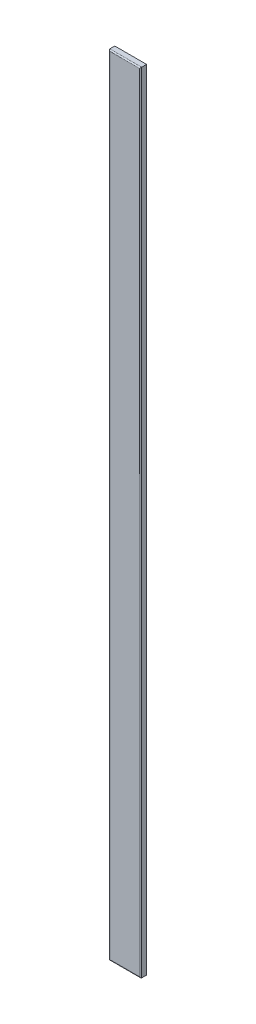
from build123d import *

# Parameters (mm, degrees)
SKETCH_1_W      = 85
SKETCH_1_H      = 2109.6
EXTRUDE_1_DEPTH = 16
FILLET_1_R      = 3


with BuildPart() as part:
    # Sketch 1 → Extrude 1 (new body)
    with BuildSketch(Plane.XY):
        with Locations((-484.6, 35)):
            Rectangle(SKETCH_1_W, SKETCH_1_H)
    extrude(amount=EXTRUDE_1_DEPTH)

    # Fillet 1
    fillet_1_edges = [part.edges().sort_by_distance(p)[0] for p in [
        (-527.1, 35, 16),
        (-484.6, -1019.8, 16),
        (-442.1, 35, 16),
        (-484.6, 1089.8, 16),
    ]]
    fillet(fillet_1_edges, radius=FILLET_1_R)


solid = part.part
